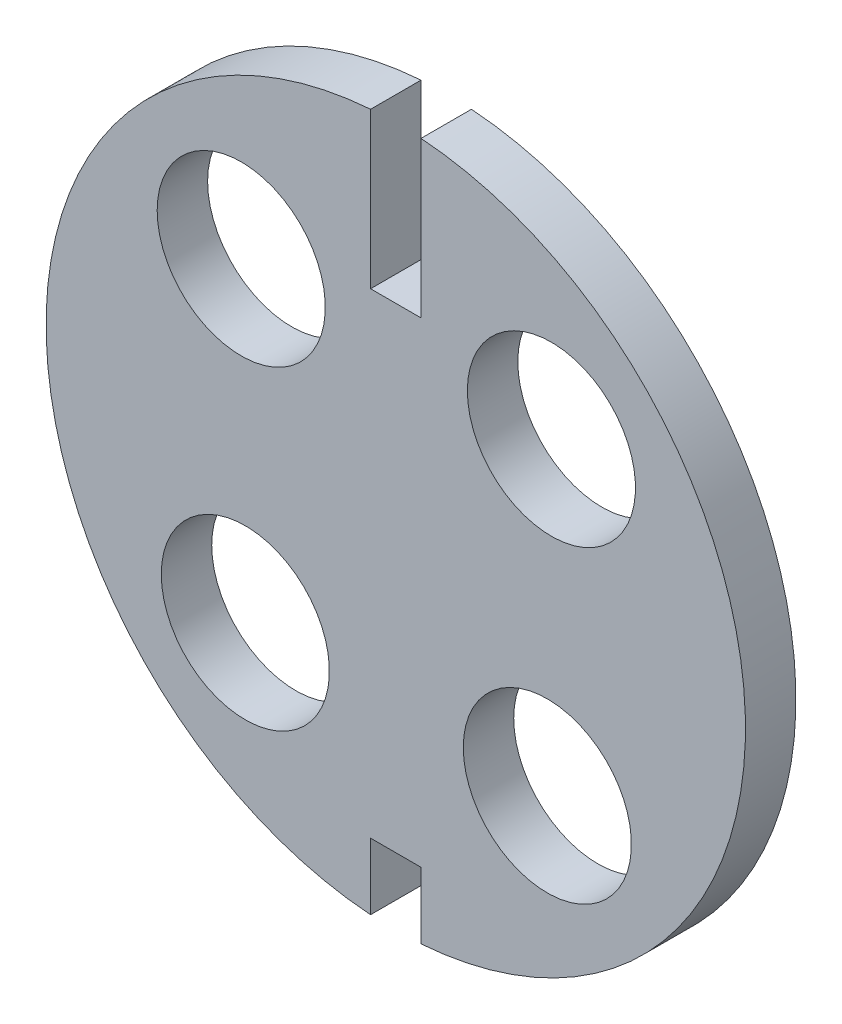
ISO-10303-21;
HEADER;
FILE_DESCRIPTION(('STEP AP214'),'2;1');
FILE_NAME('part.step','',(''),(''),'','','');
FILE_SCHEMA(('AUTOMOTIVE_DESIGN { 1 0 10303 214 1 1 1 1 }'));
ENDSEC;
DATA;
#1=APPLICATION_CONTEXT('core data for automotive mechanical design processes');
#2=APPLICATION_PROTOCOL_DEFINITION('international standard','automotive_design',2000,#1);
#3=PRODUCT_CONTEXT('',#1,'mechanical');
#4=PRODUCT('Part','Part','',(#3));
#5=PRODUCT_RELATED_PRODUCT_CATEGORY('part','',(#4));
#6=PRODUCT_DEFINITION_FORMATION('','',#4);
#7=PRODUCT_DEFINITION_CONTEXT('part definition',#1,'design');
#8=PRODUCT_DEFINITION('design','',#6,#7);
#9=PRODUCT_DEFINITION_SHAPE('','',#8);
#10=(LENGTH_UNIT() NAMED_UNIT(*) SI_UNIT(.MILLI.,.METRE.));
#11=(NAMED_UNIT(*) PLANE_ANGLE_UNIT() SI_UNIT($,.RADIAN.));
#12=(NAMED_UNIT(*) SI_UNIT($,.STERADIAN.) SOLID_ANGLE_UNIT());
#13=UNCERTAINTY_MEASURE_WITH_UNIT(LENGTH_MEASURE(1.E-05),#10,'distance_accuracy_value','');
#14=(GEOMETRIC_REPRESENTATION_CONTEXT(3) GLOBAL_UNCERTAINTY_ASSIGNED_CONTEXT((#13)) GLOBAL_UNIT_ASSIGNED_CONTEXT((#10,
#11,#12)) REPRESENTATION_CONTEXT('',''));
#15=CARTESIAN_POINT('',(0.,0.,0.));
#16=DIRECTION('',(0.,0.,1.));
#17=DIRECTION('',(1.,0.,0.));
#18=AXIS2_PLACEMENT_3D('',#15,#16,#17);
#19=CARTESIAN_POINT('',(0.,0.,3.81));
#20=DIRECTION('',(0.,0.,1.));
#21=DIRECTION('',(1.,0.,0.));
#22=AXIS2_PLACEMENT_3D('',#19,#20,#21);
#23=PLANE('',#22);
#24=CARTESIAN_POINT('',(11.4489030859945,-11.8954915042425,3.81));
#25=DIRECTION('',(0.,0.,1.));
#26=DIRECTION('',(1.,0.,0.));
#27=AXIS2_PLACEMENT_3D('',#24,#25,#26);
#28=CIRCLE('',#27,6.35);
#29=CARTESIAN_POINT('',(5.09890308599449,-11.8954915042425,3.81));
#30=VERTEX_POINT('',#29);
#31=EDGE_CURVE('E156',#30,#30,#28,.T.);
#32=ORIENTED_EDGE('',*,*,#31,.F.);
#33=EDGE_LOOP('',(#32));
#34=FACE_BOUND('',#33,.T.);
#35=CARTESIAN_POINT('',(-11.6743329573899,11.6743329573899,3.81));
#36=DIRECTION('',(0.,0.,1.));
#37=DIRECTION('',(1.,0.,0.));
#38=AXIS2_PLACEMENT_3D('',#35,#36,#37);
#39=CIRCLE('',#38,6.35);
#40=CARTESIAN_POINT('',(-18.0243329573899,11.6743329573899,3.81));
#41=VERTEX_POINT('',#40);
#42=EDGE_CURVE('E168',#41,#41,#39,.T.);
#43=ORIENTED_EDGE('',*,*,#42,.F.);
#44=EDGE_LOOP('',(#43));
#45=FACE_BOUND('',#44,.T.);
#46=CARTESIAN_POINT('',(11.7568886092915,11.5911893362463,3.81));
#47=DIRECTION('',(0.,0.,1.));
#48=DIRECTION('',(1.,0.,0.));
#49=AXIS2_PLACEMENT_3D('',#46,#47,#48);
#50=CIRCLE('',#49,6.35);
#51=CARTESIAN_POINT('',(5.40688860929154,11.5911893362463,3.81));
#52=VERTEX_POINT('',#51);
#53=EDGE_CURVE('E162',#52,#52,#50,.T.);
#54=ORIENTED_EDGE('',*,*,#53,.F.);
#55=EDGE_LOOP('',(#54));
#56=FACE_BOUND('',#55,.T.);
#57=CARTESIAN_POINT('',(-11.3642808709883,-11.9763608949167,3.81));
#58=DIRECTION('',(0.,0.,1.));
#59=DIRECTION('',(1.,0.,0.));
#60=AXIS2_PLACEMENT_3D('',#57,#58,#59);
#61=CIRCLE('',#60,6.35);
#62=CARTESIAN_POINT('',(-17.7142808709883,-11.9763608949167,3.81));
#63=VERTEX_POINT('',#62);
#64=EDGE_CURVE('E150',#63,#63,#61,.T.);
#65=ORIENTED_EDGE('',*,*,#64,.F.);
#66=EDGE_LOOP('',(#65));
#67=FACE_BOUND('',#66,.T.);
#68=DIRECTION('',(-1.,0.,0.));
#69=VECTOR('',#68,1.);
#70=CARTESIAN_POINT('',(1.905,-21.336,3.81));
#71=LINE('',#70,#69);
#72=CARTESIAN_POINT('',(1.905,-21.336,3.81));
#73=VERTEX_POINT('',#72);
#74=CARTESIAN_POINT('',(-1.905,-21.336,3.81));
#75=VERTEX_POINT('',#74);
#76=EDGE_CURVE('E125',#73,#75,#71,.T.);
#77=ORIENTED_EDGE('',*,*,#76,.F.);
#78=DIRECTION('',(0.,1.,0.));
#79=VECTOR('',#78,1.);
#80=CARTESIAN_POINT('',(1.905,-27.9234461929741,3.81));
#81=LINE('',#80,#79);
#82=CARTESIAN_POINT('',(1.905,-26.3472205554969,3.81));
#83=VERTEX_POINT('',#82);
#84=EDGE_CURVE('E114',#83,#73,#81,.T.);
#85=ORIENTED_EDGE('',*,*,#84,.F.);
#86=CARTESIAN_POINT('',(0.,0.,3.81));
#87=DIRECTION('',(0.,0.,1.));
#88=DIRECTION('',(1.,0.,0.));
#89=AXIS2_PLACEMENT_3D('',#86,#87,#88);
#90=CIRCLE('',#89,26.416);
#91=CARTESIAN_POINT('',(1.905,26.3472205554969,3.81));
#92=VERTEX_POINT('',#91);
#93=EDGE_CURVE('E54',#83,#92,#90,.T.);
#94=ORIENTED_EDGE('',*,*,#93,.T.);
#95=DIRECTION('',(0.,1.,0.));
#96=VECTOR('',#95,1.);
#97=CARTESIAN_POINT('',(1.905,27.419564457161,3.81));
#98=LINE('',#97,#96);
#99=CARTESIAN_POINT('',(1.905,14.605,3.81));
#100=VERTEX_POINT('',#99);
#101=EDGE_CURVE('E140',#100,#92,#98,.T.);
#102=ORIENTED_EDGE('',*,*,#101,.F.);
#103=DIRECTION('',(1.,0.,0.));
#104=VECTOR('',#103,1.);
#105=CARTESIAN_POINT('',(-1.905,14.605,3.81));
#106=LINE('',#105,#104);
#107=CARTESIAN_POINT('',(-1.905,14.605,3.81));
#108=VERTEX_POINT('',#107);
#109=EDGE_CURVE('E138',#108,#100,#106,.T.);
#110=ORIENTED_EDGE('',*,*,#109,.F.);
#111=DIRECTION('',(0.,-1.,0.));
#112=VECTOR('',#111,1.);
#113=CARTESIAN_POINT('',(-1.905,27.419564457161,3.81));
#114=LINE('',#113,#112);
#115=CARTESIAN_POINT('',(-1.905,26.3472205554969,3.81));
#116=VERTEX_POINT('',#115);
#117=EDGE_CURVE('E136',#116,#108,#114,.T.);
#118=ORIENTED_EDGE('',*,*,#117,.F.);
#119=CARTESIAN_POINT('',(-1.905,-26.3472205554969,3.81));
#120=VERTEX_POINT('',#119);
#121=EDGE_CURVE('E174',#116,#120,#90,.T.);
#122=ORIENTED_EDGE('',*,*,#121,.T.);
#123=DIRECTION('',(0.,-1.,0.));
#124=VECTOR('',#123,1.);
#125=CARTESIAN_POINT('',(-1.905,-27.9234461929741,3.81));
#126=LINE('',#125,#124);
#127=EDGE_CURVE('E46',#75,#120,#126,.T.);
#128=ORIENTED_EDGE('',*,*,#127,.F.);
#129=EDGE_LOOP('',(#77,#85,#94,#102,#110,#118,#122,#128));
#130=FACE_BOUND('',#129,.T.);
#131=ADVANCED_FACE('F31',(#34,#45,#56,#67,#130),#23,.T.);
#132=CARTESIAN_POINT('',(0.,0.,0.));
#133=DIRECTION('',(0.,0.,1.));
#134=DIRECTION('',(1.,0.,0.));
#135=AXIS2_PLACEMENT_3D('',#132,#133,#134);
#136=PLANE('',#135);
#137=CARTESIAN_POINT('',(11.4489030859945,-11.8954915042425,0.));
#138=DIRECTION('',(0.,0.,1.));
#139=DIRECTION('',(1.,0.,0.));
#140=AXIS2_PLACEMENT_3D('',#137,#138,#139);
#141=CIRCLE('',#140,6.35);
#142=CARTESIAN_POINT('',(5.09890308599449,-11.8954915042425,0.));
#143=VERTEX_POINT('',#142);
#144=EDGE_CURVE('E153',#143,#143,#141,.T.);
#145=ORIENTED_EDGE('',*,*,#144,.T.);
#146=EDGE_LOOP('',(#145));
#147=FACE_BOUND('',#146,.T.);
#148=CARTESIAN_POINT('',(-11.6743329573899,11.6743329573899,0.));
#149=DIRECTION('',(0.,0.,1.));
#150=DIRECTION('',(1.,0.,0.));
#151=AXIS2_PLACEMENT_3D('',#148,#149,#150);
#152=CIRCLE('',#151,6.35);
#153=CARTESIAN_POINT('',(-18.0243329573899,11.6743329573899,0.));
#154=VERTEX_POINT('',#153);
#155=EDGE_CURVE('E165',#154,#154,#152,.T.);
#156=ORIENTED_EDGE('',*,*,#155,.T.);
#157=EDGE_LOOP('',(#156));
#158=FACE_BOUND('',#157,.T.);
#159=CARTESIAN_POINT('',(11.7568886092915,11.5911893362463,0.));
#160=DIRECTION('',(0.,0.,1.));
#161=DIRECTION('',(1.,0.,0.));
#162=AXIS2_PLACEMENT_3D('',#159,#160,#161);
#163=CIRCLE('',#162,6.35);
#164=CARTESIAN_POINT('',(5.40688860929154,11.5911893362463,0.));
#165=VERTEX_POINT('',#164);
#166=EDGE_CURVE('E159',#165,#165,#163,.T.);
#167=ORIENTED_EDGE('',*,*,#166,.T.);
#168=EDGE_LOOP('',(#167));
#169=FACE_BOUND('',#168,.T.);
#170=CARTESIAN_POINT('',(-11.3642808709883,-11.9763608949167,0.));
#171=DIRECTION('',(0.,0.,1.));
#172=DIRECTION('',(1.,0.,0.));
#173=AXIS2_PLACEMENT_3D('',#170,#171,#172);
#174=CIRCLE('',#173,6.35);
#175=CARTESIAN_POINT('',(-17.7142808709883,-11.9763608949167,0.));
#176=VERTEX_POINT('',#175);
#177=EDGE_CURVE('E147',#176,#176,#174,.T.);
#178=ORIENTED_EDGE('',*,*,#177,.T.);
#179=EDGE_LOOP('',(#178));
#180=FACE_BOUND('',#179,.T.);
#181=DIRECTION('',(0.,1.,0.));
#182=VECTOR('',#181,1.);
#183=CARTESIAN_POINT('',(1.905,-27.9234461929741,0.));
#184=LINE('',#183,#182);
#185=CARTESIAN_POINT('',(1.905,-26.3472205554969,0.));
#186=VERTEX_POINT('',#185);
#187=CARTESIAN_POINT('',(1.905,-21.336,0.));
#188=VERTEX_POINT('',#187);
#189=EDGE_CURVE('E109',#186,#188,#184,.T.);
#190=ORIENTED_EDGE('',*,*,#189,.T.);
#191=DIRECTION('',(-1.,0.,0.));
#192=VECTOR('',#191,1.);
#193=CARTESIAN_POINT('',(1.905,-21.336,0.));
#194=LINE('',#193,#192);
#195=CARTESIAN_POINT('',(-1.905,-21.336,0.));
#196=VERTEX_POINT('',#195);
#197=EDGE_CURVE('E98',#188,#196,#194,.T.);
#198=ORIENTED_EDGE('',*,*,#197,.T.);
#199=DIRECTION('',(0.,-1.,0.));
#200=VECTOR('',#199,1.);
#201=CARTESIAN_POINT('',(-1.905,-27.9234461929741,0.));
#202=LINE('',#201,#200);
#203=CARTESIAN_POINT('',(-1.905,-26.3472205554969,0.));
#204=VERTEX_POINT('',#203);
#205=EDGE_CURVE('E108',#196,#204,#202,.T.);
#206=ORIENTED_EDGE('',*,*,#205,.T.);
#207=CARTESIAN_POINT('',(0.,0.,0.));
#208=DIRECTION('',(0.,0.,1.));
#209=DIRECTION('',(1.,0.,0.));
#210=AXIS2_PLACEMENT_3D('',#207,#208,#209);
#211=CIRCLE('',#210,26.416);
#212=CARTESIAN_POINT('',(-1.905,26.3472205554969,0.));
#213=VERTEX_POINT('',#212);
#214=EDGE_CURVE('E171',#213,#204,#211,.T.);
#215=ORIENTED_EDGE('',*,*,#214,.F.);
#216=DIRECTION('',(0.,-1.,0.));
#217=VECTOR('',#216,1.);
#218=CARTESIAN_POINT('',(-1.905,27.419564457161,0.));
#219=LINE('',#218,#217);
#220=CARTESIAN_POINT('',(-1.905,14.605,0.));
#221=VERTEX_POINT('',#220);
#222=EDGE_CURVE('E115',#213,#221,#219,.T.);
#223=ORIENTED_EDGE('',*,*,#222,.T.);
#224=DIRECTION('',(1.,0.,0.));
#225=VECTOR('',#224,1.);
#226=CARTESIAN_POINT('',(-1.905,14.605,0.));
#227=LINE('',#226,#225);
#228=CARTESIAN_POINT('',(1.905,14.605,0.));
#229=VERTEX_POINT('',#228);
#230=EDGE_CURVE('E131',#221,#229,#227,.T.);
#231=ORIENTED_EDGE('',*,*,#230,.T.);
#232=DIRECTION('',(0.,1.,0.));
#233=VECTOR('',#232,1.);
#234=CARTESIAN_POINT('',(1.905,27.419564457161,0.));
#235=LINE('',#234,#233);
#236=CARTESIAN_POINT('',(1.905,26.3472205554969,0.));
#237=VERTEX_POINT('',#236);
#238=EDGE_CURVE('E134',#229,#237,#235,.T.);
#239=ORIENTED_EDGE('',*,*,#238,.T.);
#240=EDGE_CURVE('E120',#186,#237,#211,.T.);
#241=ORIENTED_EDGE('',*,*,#240,.F.);
#242=EDGE_LOOP('',(#190,#198,#206,#215,#223,#231,#239,#241));
#243=FACE_BOUND('',#242,.T.);
#244=ADVANCED_FACE('F118',(#147,#158,#169,#180,#243),#136,.F.);
#245=CARTESIAN_POINT('',(0.,0.,3.81));
#246=DIRECTION('',(0.,0.,-1.));
#247=DIRECTION('',(-1.,0.,0.));
#248=AXIS2_PLACEMENT_3D('',#245,#246,#247);
#249=CYLINDRICAL_SURFACE('',#248,26.416);
#250=DIRECTION('',(0.,0.,-1.));
#251=VECTOR('',#250,1.);
#252=CARTESIAN_POINT('',(1.905,-26.3472205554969,3.81));
#253=LINE('',#252,#251);
#254=EDGE_CURVE('E11',#186,#83,#253,.F.);
#255=ORIENTED_EDGE('',*,*,#254,.F.);
#256=ORIENTED_EDGE('',*,*,#240,.T.);
#257=DIRECTION('',(0.,0.,-1.));
#258=VECTOR('',#257,1.);
#259=CARTESIAN_POINT('',(1.905,26.3472205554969,3.81));
#260=LINE('',#259,#258);
#261=EDGE_CURVE('E177',#92,#237,#260,.T.);
#262=ORIENTED_EDGE('',*,*,#261,.F.);
#263=ORIENTED_EDGE('',*,*,#93,.F.);
#264=EDGE_LOOP('',(#255,#256,#262,#263));
#265=FACE_BOUND('',#264,.T.);
#266=ADVANCED_FACE('F33',(#265),#249,.T.);
#267=DIRECTION('',(0.,0.,-1.));
#268=VECTOR('',#267,1.);
#269=CARTESIAN_POINT('',(-1.905,-26.3472205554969,3.81));
#270=LINE('',#269,#268);
#271=EDGE_CURVE('E39',#120,#204,#270,.T.);
#272=ORIENTED_EDGE('',*,*,#271,.F.);
#273=ORIENTED_EDGE('',*,*,#121,.F.);
#274=DIRECTION('',(0.,0.,-1.));
#275=VECTOR('',#274,1.);
#276=CARTESIAN_POINT('',(-1.905,26.3472205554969,3.81));
#277=LINE('',#276,#275);
#278=EDGE_CURVE('E180',#213,#116,#277,.F.);
#279=ORIENTED_EDGE('',*,*,#278,.F.);
#280=ORIENTED_EDGE('',*,*,#214,.T.);
#281=EDGE_LOOP('',(#272,#273,#279,#280));
#282=FACE_BOUND('',#281,.T.);
#283=ADVANCED_FACE('F186',(#282),#249,.T.);
#284=CARTESIAN_POINT('',(-11.6743329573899,11.6743329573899,3.81));
#285=DIRECTION('',(0.,0.,-1.));
#286=DIRECTION('',(-1.,0.,0.));
#287=AXIS2_PLACEMENT_3D('',#284,#285,#286);
#288=CYLINDRICAL_SURFACE('',#287,6.35);
#289=CARTESIAN_POINT('',(-18.0243329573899,11.6743329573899,3.81));
#290=CARTESIAN_POINT('',(-18.0243329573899,11.6743329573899,3.7703125));
#291=CARTESIAN_POINT('',(-18.0243329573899,11.6743329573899,3.730625));
#292=CARTESIAN_POINT('',(-18.0243329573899,11.6743329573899,3.65125));
#293=CARTESIAN_POINT('',(-18.0243329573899,11.6743329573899,3.6115625));
#294=CARTESIAN_POINT('',(-18.0243329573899,11.6743329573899,3.5321875));
#295=CARTESIAN_POINT('',(-18.0243329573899,11.6743329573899,3.4925));
#296=CARTESIAN_POINT('',(-18.0243329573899,11.6743329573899,3.413125));
#297=CARTESIAN_POINT('',(-18.0243329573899,11.6743329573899,3.3734375));
#298=CARTESIAN_POINT('',(-18.0243329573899,11.6743329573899,3.2940625));
#299=CARTESIAN_POINT('',(-18.0243329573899,11.6743329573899,3.254375));
#300=CARTESIAN_POINT('',(-18.0243329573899,11.6743329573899,3.175));
#301=CARTESIAN_POINT('',(-18.0243329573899,11.6743329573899,3.1353125));
#302=CARTESIAN_POINT('',(-18.0243329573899,11.6743329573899,3.0559375));
#303=CARTESIAN_POINT('',(-18.0243329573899,11.6743329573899,3.01625));
#304=CARTESIAN_POINT('',(-18.0243329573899,11.6743329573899,2.936875));
#305=CARTESIAN_POINT('',(-18.0243329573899,11.6743329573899,2.8971875));
#306=CARTESIAN_POINT('',(-18.0243329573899,11.6743329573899,2.8178125));
#307=CARTESIAN_POINT('',(-18.0243329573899,11.6743329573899,2.778125));
#308=CARTESIAN_POINT('',(-18.0243329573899,11.6743329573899,2.69875));
#309=CARTESIAN_POINT('',(-18.0243329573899,11.6743329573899,2.6590625));
#310=CARTESIAN_POINT('',(-18.0243329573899,11.6743329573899,2.5796875));
#311=CARTESIAN_POINT('',(-18.0243329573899,11.6743329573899,2.54));
#312=CARTESIAN_POINT('',(-18.0243329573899,11.6743329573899,2.460625));
#313=CARTESIAN_POINT('',(-18.0243329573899,11.6743329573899,2.4209375));
#314=CARTESIAN_POINT('',(-18.0243329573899,11.6743329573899,2.3415625));
#315=CARTESIAN_POINT('',(-18.0243329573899,11.6743329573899,2.301875));
#316=CARTESIAN_POINT('',(-18.0243329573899,11.6743329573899,2.2225));
#317=CARTESIAN_POINT('',(-18.0243329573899,11.6743329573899,2.1828125));
#318=CARTESIAN_POINT('',(-18.0243329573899,11.6743329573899,2.1034375));
#319=CARTESIAN_POINT('',(-18.0243329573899,11.6743329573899,2.06375));
#320=CARTESIAN_POINT('',(-18.0243329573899,11.6743329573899,1.984375));
#321=CARTESIAN_POINT('',(-18.0243329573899,11.6743329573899,1.9446875));
#322=CARTESIAN_POINT('',(-18.0243329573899,11.6743329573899,1.8653125));
#323=CARTESIAN_POINT('',(-18.0243329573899,11.6743329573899,1.825625));
#324=CARTESIAN_POINT('',(-18.0243329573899,11.6743329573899,1.74625));
#325=CARTESIAN_POINT('',(-18.0243329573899,11.6743329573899,1.7065625));
#326=CARTESIAN_POINT('',(-18.0243329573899,11.6743329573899,1.6271875));
#327=CARTESIAN_POINT('',(-18.0243329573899,11.6743329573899,1.5875));
#328=CARTESIAN_POINT('',(-18.0243329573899,11.6743329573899,1.508125));
#329=CARTESIAN_POINT('',(-18.0243329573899,11.6743329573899,1.4684375));
#330=CARTESIAN_POINT('',(-18.0243329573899,11.6743329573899,1.3890625));
#331=CARTESIAN_POINT('',(-18.0243329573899,11.6743329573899,1.349375));
#332=CARTESIAN_POINT('',(-18.0243329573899,11.6743329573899,1.27));
#333=CARTESIAN_POINT('',(-18.0243329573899,11.6743329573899,1.2303125));
#334=CARTESIAN_POINT('',(-18.0243329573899,11.6743329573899,1.1509375));
#335=CARTESIAN_POINT('',(-18.0243329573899,11.6743329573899,1.11125));
#336=CARTESIAN_POINT('',(-18.0243329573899,11.6743329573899,1.031875));
#337=CARTESIAN_POINT('',(-18.0243329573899,11.6743329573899,0.9921875));
#338=CARTESIAN_POINT('',(-18.0243329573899,11.6743329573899,0.9128125));
#339=CARTESIAN_POINT('',(-18.0243329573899,11.6743329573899,0.873125));
#340=CARTESIAN_POINT('',(-18.0243329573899,11.6743329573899,0.79375));
#341=CARTESIAN_POINT('',(-18.0243329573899,11.6743329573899,0.7540625));
#342=CARTESIAN_POINT('',(-18.0243329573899,11.6743329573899,0.6746875));
#343=CARTESIAN_POINT('',(-18.0243329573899,11.6743329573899,0.635));
#344=CARTESIAN_POINT('',(-18.0243329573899,11.6743329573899,0.555625));
#345=CARTESIAN_POINT('',(-18.0243329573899,11.6743329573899,0.5159375));
#346=CARTESIAN_POINT('',(-18.0243329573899,11.6743329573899,0.4365625));
#347=CARTESIAN_POINT('',(-18.0243329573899,11.6743329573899,0.396875));
#348=CARTESIAN_POINT('',(-18.0243329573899,11.6743329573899,0.3175));
#349=CARTESIAN_POINT('',(-18.0243329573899,11.6743329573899,0.2778125));
#350=CARTESIAN_POINT('',(-18.0243329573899,11.6743329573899,0.1984375));
#351=CARTESIAN_POINT('',(-18.0243329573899,11.6743329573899,0.15875));
#352=CARTESIAN_POINT('',(-18.0243329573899,11.6743329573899,0.0793749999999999));
#353=CARTESIAN_POINT('',(-18.0243329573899,11.6743329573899,0.0396874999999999));
#354=CARTESIAN_POINT('',(-18.0243329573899,11.6743329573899,0.));
#355=B_SPLINE_CURVE_WITH_KNOTS('',3,(#289,#290,#291,#292,#293,#294,#295,#296,#297,#298,#299,
#300,#301,#302,#303,#304,#305,#306,#307,#308,#309,#310,#311,#312,#313,#314,#315,#316,#317,#318,
#319,#320,#321,#322,#323,#324,#325,#326,#327,#328,#329,#330,#331,#332,#333,#334,#335,#336,#337,
#338,#339,#340,#341,#342,#343,#344,#345,#346,#347,#348,#349,#350,#351,#352,#353,#354),
.UNSPECIFIED.,.F.,.F.,(4,2,2,2,2,2,2,2,2,2,2,2,2,2,2,2,2,2,2,2,2,2,2,2,2,2,2,2,2,2,2,2,4),(0.,
0.1190625,0.238125,0.3571875,0.47625,0.5953125,0.714375,0.8334375,0.9525,1.0715625,1.190625,
1.3096875,1.42875,1.5478125,1.666875,1.7859375,1.905,2.0240625,2.143125,2.2621875,2.38125,
2.5003125,2.619375,2.7384375,2.8575,2.9765625,3.095625,3.2146875,3.33375,3.4528125,3.571875,
3.6909375,3.81),.UNSPECIFIED.);
#356=EDGE_CURVE('BSEAM205',#41,#154,#355,.T.);
#357=ORIENTED_EDGE('',*,*,#42,.T.);
#358=ORIENTED_EDGE('',*,*,#155,.F.);
#359=ORIENTED_EDGE('',*,*,#356,.T.);
#360=ORIENTED_EDGE('',*,*,#356,.F.);
#361=EDGE_LOOP('',(#357,#359,#358,#360));
#362=FACE_BOUND('',#361,.T.);
#363=ADVANCED_FACE('F205',(#362),#288,.F.);
#364=CARTESIAN_POINT('',(11.7568886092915,11.5911893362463,3.81));
#365=DIRECTION('',(0.,0.,-1.));
#366=DIRECTION('',(-1.,0.,0.));
#367=AXIS2_PLACEMENT_3D('',#364,#365,#366);
#368=CYLINDRICAL_SURFACE('',#367,6.35);
#369=CARTESIAN_POINT('',(5.40688860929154,11.5911893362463,3.81));
#370=CARTESIAN_POINT('',(5.40688860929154,11.5911893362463,3.7703125));
#371=CARTESIAN_POINT('',(5.40688860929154,11.5911893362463,3.730625));
#372=CARTESIAN_POINT('',(5.40688860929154,11.5911893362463,3.65125));
#373=CARTESIAN_POINT('',(5.40688860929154,11.5911893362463,3.6115625));
#374=CARTESIAN_POINT('',(5.40688860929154,11.5911893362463,3.5321875));
#375=CARTESIAN_POINT('',(5.40688860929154,11.5911893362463,3.4925));
#376=CARTESIAN_POINT('',(5.40688860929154,11.5911893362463,3.413125));
#377=CARTESIAN_POINT('',(5.40688860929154,11.5911893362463,3.3734375));
#378=CARTESIAN_POINT('',(5.40688860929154,11.5911893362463,3.2940625));
#379=CARTESIAN_POINT('',(5.40688860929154,11.5911893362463,3.254375));
#380=CARTESIAN_POINT('',(5.40688860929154,11.5911893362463,3.175));
#381=CARTESIAN_POINT('',(5.40688860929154,11.5911893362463,3.1353125));
#382=CARTESIAN_POINT('',(5.40688860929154,11.5911893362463,3.0559375));
#383=CARTESIAN_POINT('',(5.40688860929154,11.5911893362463,3.01625));
#384=CARTESIAN_POINT('',(5.40688860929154,11.5911893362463,2.936875));
#385=CARTESIAN_POINT('',(5.40688860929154,11.5911893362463,2.8971875));
#386=CARTESIAN_POINT('',(5.40688860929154,11.5911893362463,2.8178125));
#387=CARTESIAN_POINT('',(5.40688860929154,11.5911893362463,2.778125));
#388=CARTESIAN_POINT('',(5.40688860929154,11.5911893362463,2.69875));
#389=CARTESIAN_POINT('',(5.40688860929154,11.5911893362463,2.6590625));
#390=CARTESIAN_POINT('',(5.40688860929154,11.5911893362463,2.5796875));
#391=CARTESIAN_POINT('',(5.40688860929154,11.5911893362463,2.54));
#392=CARTESIAN_POINT('',(5.40688860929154,11.5911893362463,2.460625));
#393=CARTESIAN_POINT('',(5.40688860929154,11.5911893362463,2.4209375));
#394=CARTESIAN_POINT('',(5.40688860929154,11.5911893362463,2.3415625));
#395=CARTESIAN_POINT('',(5.40688860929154,11.5911893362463,2.301875));
#396=CARTESIAN_POINT('',(5.40688860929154,11.5911893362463,2.2225));
#397=CARTESIAN_POINT('',(5.40688860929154,11.5911893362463,2.1828125));
#398=CARTESIAN_POINT('',(5.40688860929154,11.5911893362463,2.1034375));
#399=CARTESIAN_POINT('',(5.40688860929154,11.5911893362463,2.06375));
#400=CARTESIAN_POINT('',(5.40688860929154,11.5911893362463,1.984375));
#401=CARTESIAN_POINT('',(5.40688860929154,11.5911893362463,1.9446875));
#402=CARTESIAN_POINT('',(5.40688860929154,11.5911893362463,1.8653125));
#403=CARTESIAN_POINT('',(5.40688860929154,11.5911893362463,1.825625));
#404=CARTESIAN_POINT('',(5.40688860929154,11.5911893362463,1.74625));
#405=CARTESIAN_POINT('',(5.40688860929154,11.5911893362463,1.7065625));
#406=CARTESIAN_POINT('',(5.40688860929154,11.5911893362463,1.6271875));
#407=CARTESIAN_POINT('',(5.40688860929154,11.5911893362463,1.5875));
#408=CARTESIAN_POINT('',(5.40688860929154,11.5911893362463,1.508125));
#409=CARTESIAN_POINT('',(5.40688860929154,11.5911893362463,1.4684375));
#410=CARTESIAN_POINT('',(5.40688860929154,11.5911893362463,1.3890625));
#411=CARTESIAN_POINT('',(5.40688860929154,11.5911893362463,1.349375));
#412=CARTESIAN_POINT('',(5.40688860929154,11.5911893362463,1.27));
#413=CARTESIAN_POINT('',(5.40688860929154,11.5911893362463,1.2303125));
#414=CARTESIAN_POINT('',(5.40688860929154,11.5911893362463,1.1509375));
#415=CARTESIAN_POINT('',(5.40688860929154,11.5911893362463,1.11125));
#416=CARTESIAN_POINT('',(5.40688860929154,11.5911893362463,1.031875));
#417=CARTESIAN_POINT('',(5.40688860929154,11.5911893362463,0.9921875));
#418=CARTESIAN_POINT('',(5.40688860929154,11.5911893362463,0.9128125));
#419=CARTESIAN_POINT('',(5.40688860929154,11.5911893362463,0.873125));
#420=CARTESIAN_POINT('',(5.40688860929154,11.5911893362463,0.79375));
#421=CARTESIAN_POINT('',(5.40688860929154,11.5911893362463,0.7540625));
#422=CARTESIAN_POINT('',(5.40688860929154,11.5911893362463,0.6746875));
#423=CARTESIAN_POINT('',(5.40688860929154,11.5911893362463,0.635));
#424=CARTESIAN_POINT('',(5.40688860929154,11.5911893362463,0.555625));
#425=CARTESIAN_POINT('',(5.40688860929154,11.5911893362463,0.5159375));
#426=CARTESIAN_POINT('',(5.40688860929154,11.5911893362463,0.4365625));
#427=CARTESIAN_POINT('',(5.40688860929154,11.5911893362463,0.396875));
#428=CARTESIAN_POINT('',(5.40688860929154,11.5911893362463,0.3175));
#429=CARTESIAN_POINT('',(5.40688860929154,11.5911893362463,0.2778125));
#430=CARTESIAN_POINT('',(5.40688860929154,11.5911893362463,0.1984375));
#431=CARTESIAN_POINT('',(5.40688860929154,11.5911893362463,0.15875));
#432=CARTESIAN_POINT('',(5.40688860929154,11.5911893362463,0.0793749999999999));
#433=CARTESIAN_POINT('',(5.40688860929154,11.5911893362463,0.0396874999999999));
#434=CARTESIAN_POINT('',(5.40688860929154,11.5911893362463,0.));
#435=B_SPLINE_CURVE_WITH_KNOTS('',3,(#369,#370,#371,#372,#373,#374,#375,#376,#377,#378,#379,
#380,#381,#382,#383,#384,#385,#386,#387,#388,#389,#390,#391,#392,#393,#394,#395,#396,#397,#398,
#399,#400,#401,#402,#403,#404,#405,#406,#407,#408,#409,#410,#411,#412,#413,#414,#415,#416,#417,
#418,#419,#420,#421,#422,#423,#424,#425,#426,#427,#428,#429,#430,#431,#432,#433,#434),
.UNSPECIFIED.,.F.,.F.,(4,2,2,2,2,2,2,2,2,2,2,2,2,2,2,2,2,2,2,2,2,2,2,2,2,2,2,2,2,2,2,2,4),(0.,
0.1190625,0.238125,0.3571875,0.47625,0.5953125,0.714375,0.8334375,0.9525,1.0715625,1.190625,
1.3096875,1.42875,1.5478125,1.666875,1.7859375,1.905,2.0240625,2.143125,2.2621875,2.38125,
2.5003125,2.619375,2.7384375,2.8575,2.9765625,3.095625,3.2146875,3.33375,3.4528125,3.571875,
3.6909375,3.81),.UNSPECIFIED.);
#436=EDGE_CURVE('BSEAM217',#52,#165,#435,.T.);
#437=ORIENTED_EDGE('',*,*,#53,.T.);
#438=ORIENTED_EDGE('',*,*,#166,.F.);
#439=ORIENTED_EDGE('',*,*,#436,.T.);
#440=ORIENTED_EDGE('',*,*,#436,.F.);
#441=EDGE_LOOP('',(#437,#439,#438,#440));
#442=FACE_BOUND('',#441,.T.);
#443=ADVANCED_FACE('F217',(#442),#368,.F.);
#444=CARTESIAN_POINT('',(11.4489030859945,-11.8954915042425,3.81));
#445=DIRECTION('',(0.,0.,-1.));
#446=DIRECTION('',(-1.,0.,0.));
#447=AXIS2_PLACEMENT_3D('',#444,#445,#446);
#448=CYLINDRICAL_SURFACE('',#447,6.35);
#449=CARTESIAN_POINT('',(5.09890308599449,-11.8954915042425,3.81));
#450=CARTESIAN_POINT('',(5.09890308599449,-11.8954915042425,3.7703125));
#451=CARTESIAN_POINT('',(5.09890308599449,-11.8954915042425,3.730625));
#452=CARTESIAN_POINT('',(5.09890308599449,-11.8954915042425,3.65125));
#453=CARTESIAN_POINT('',(5.09890308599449,-11.8954915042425,3.6115625));
#454=CARTESIAN_POINT('',(5.09890308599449,-11.8954915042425,3.5321875));
#455=CARTESIAN_POINT('',(5.09890308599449,-11.8954915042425,3.4925));
#456=CARTESIAN_POINT('',(5.09890308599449,-11.8954915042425,3.413125));
#457=CARTESIAN_POINT('',(5.09890308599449,-11.8954915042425,3.3734375));
#458=CARTESIAN_POINT('',(5.09890308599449,-11.8954915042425,3.2940625));
#459=CARTESIAN_POINT('',(5.09890308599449,-11.8954915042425,3.254375));
#460=CARTESIAN_POINT('',(5.09890308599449,-11.8954915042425,3.175));
#461=CARTESIAN_POINT('',(5.09890308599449,-11.8954915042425,3.1353125));
#462=CARTESIAN_POINT('',(5.09890308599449,-11.8954915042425,3.0559375));
#463=CARTESIAN_POINT('',(5.09890308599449,-11.8954915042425,3.01625));
#464=CARTESIAN_POINT('',(5.09890308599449,-11.8954915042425,2.936875));
#465=CARTESIAN_POINT('',(5.09890308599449,-11.8954915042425,2.8971875));
#466=CARTESIAN_POINT('',(5.09890308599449,-11.8954915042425,2.8178125));
#467=CARTESIAN_POINT('',(5.09890308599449,-11.8954915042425,2.778125));
#468=CARTESIAN_POINT('',(5.09890308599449,-11.8954915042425,2.69875));
#469=CARTESIAN_POINT('',(5.09890308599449,-11.8954915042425,2.6590625));
#470=CARTESIAN_POINT('',(5.09890308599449,-11.8954915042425,2.5796875));
#471=CARTESIAN_POINT('',(5.09890308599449,-11.8954915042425,2.54));
#472=CARTESIAN_POINT('',(5.09890308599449,-11.8954915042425,2.460625));
#473=CARTESIAN_POINT('',(5.09890308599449,-11.8954915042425,2.4209375));
#474=CARTESIAN_POINT('',(5.09890308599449,-11.8954915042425,2.3415625));
#475=CARTESIAN_POINT('',(5.09890308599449,-11.8954915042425,2.301875));
#476=CARTESIAN_POINT('',(5.09890308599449,-11.8954915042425,2.2225));
#477=CARTESIAN_POINT('',(5.09890308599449,-11.8954915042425,2.1828125));
#478=CARTESIAN_POINT('',(5.09890308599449,-11.8954915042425,2.1034375));
#479=CARTESIAN_POINT('',(5.09890308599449,-11.8954915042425,2.06375));
#480=CARTESIAN_POINT('',(5.09890308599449,-11.8954915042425,1.984375));
#481=CARTESIAN_POINT('',(5.09890308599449,-11.8954915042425,1.9446875));
#482=CARTESIAN_POINT('',(5.09890308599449,-11.8954915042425,1.8653125));
#483=CARTESIAN_POINT('',(5.09890308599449,-11.8954915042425,1.825625));
#484=CARTESIAN_POINT('',(5.09890308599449,-11.8954915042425,1.74625));
#485=CARTESIAN_POINT('',(5.09890308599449,-11.8954915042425,1.7065625));
#486=CARTESIAN_POINT('',(5.09890308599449,-11.8954915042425,1.6271875));
#487=CARTESIAN_POINT('',(5.09890308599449,-11.8954915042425,1.5875));
#488=CARTESIAN_POINT('',(5.09890308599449,-11.8954915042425,1.508125));
#489=CARTESIAN_POINT('',(5.09890308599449,-11.8954915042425,1.4684375));
#490=CARTESIAN_POINT('',(5.09890308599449,-11.8954915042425,1.3890625));
#491=CARTESIAN_POINT('',(5.09890308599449,-11.8954915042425,1.349375));
#492=CARTESIAN_POINT('',(5.09890308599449,-11.8954915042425,1.27));
#493=CARTESIAN_POINT('',(5.09890308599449,-11.8954915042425,1.2303125));
#494=CARTESIAN_POINT('',(5.09890308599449,-11.8954915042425,1.1509375));
#495=CARTESIAN_POINT('',(5.09890308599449,-11.8954915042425,1.11125));
#496=CARTESIAN_POINT('',(5.09890308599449,-11.8954915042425,1.031875));
#497=CARTESIAN_POINT('',(5.09890308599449,-11.8954915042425,0.9921875));
#498=CARTESIAN_POINT('',(5.09890308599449,-11.8954915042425,0.9128125));
#499=CARTESIAN_POINT('',(5.09890308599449,-11.8954915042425,0.873125));
#500=CARTESIAN_POINT('',(5.09890308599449,-11.8954915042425,0.79375));
#501=CARTESIAN_POINT('',(5.09890308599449,-11.8954915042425,0.7540625));
#502=CARTESIAN_POINT('',(5.09890308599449,-11.8954915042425,0.6746875));
#503=CARTESIAN_POINT('',(5.09890308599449,-11.8954915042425,0.635));
#504=CARTESIAN_POINT('',(5.09890308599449,-11.8954915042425,0.555625));
#505=CARTESIAN_POINT('',(5.09890308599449,-11.8954915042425,0.5159375));
#506=CARTESIAN_POINT('',(5.09890308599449,-11.8954915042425,0.4365625));
#507=CARTESIAN_POINT('',(5.09890308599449,-11.8954915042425,0.396875));
#508=CARTESIAN_POINT('',(5.09890308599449,-11.8954915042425,0.3175));
#509=CARTESIAN_POINT('',(5.09890308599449,-11.8954915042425,0.2778125));
#510=CARTESIAN_POINT('',(5.09890308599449,-11.8954915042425,0.1984375));
#511=CARTESIAN_POINT('',(5.09890308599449,-11.8954915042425,0.15875));
#512=CARTESIAN_POINT('',(5.09890308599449,-11.8954915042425,0.0793749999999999));
#513=CARTESIAN_POINT('',(5.09890308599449,-11.8954915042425,0.0396874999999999));
#514=CARTESIAN_POINT('',(5.09890308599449,-11.8954915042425,0.));
#515=B_SPLINE_CURVE_WITH_KNOTS('',3,(#449,#450,#451,#452,#453,#454,#455,#456,#457,#458,#459,
#460,#461,#462,#463,#464,#465,#466,#467,#468,#469,#470,#471,#472,#473,#474,#475,#476,#477,#478,
#479,#480,#481,#482,#483,#484,#485,#486,#487,#488,#489,#490,#491,#492,#493,#494,#495,#496,#497,
#498,#499,#500,#501,#502,#503,#504,#505,#506,#507,#508,#509,#510,#511,#512,#513,#514),
.UNSPECIFIED.,.F.,.F.,(4,2,2,2,2,2,2,2,2,2,2,2,2,2,2,2,2,2,2,2,2,2,2,2,2,2,2,2,2,2,2,2,4),(0.,
0.1190625,0.238125,0.3571875,0.47625,0.5953125,0.714375,0.8334375,0.9525,1.0715625,1.190625,
1.3096875,1.42875,1.5478125,1.666875,1.7859375,1.905,2.0240625,2.143125,2.2621875,2.38125,
2.5003125,2.619375,2.7384375,2.8575,2.9765625,3.095625,3.2146875,3.33375,3.4528125,3.571875,
3.6909375,3.81),.UNSPECIFIED.);
#516=EDGE_CURVE('BSEAM221',#30,#143,#515,.T.);
#517=ORIENTED_EDGE('',*,*,#31,.T.);
#518=ORIENTED_EDGE('',*,*,#144,.F.);
#519=ORIENTED_EDGE('',*,*,#516,.T.);
#520=ORIENTED_EDGE('',*,*,#516,.F.);
#521=EDGE_LOOP('',(#517,#519,#518,#520));
#522=FACE_BOUND('',#521,.T.);
#523=ADVANCED_FACE('F221',(#522),#448,.F.);
#524=CARTESIAN_POINT('',(-11.3642808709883,-11.9763608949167,3.81));
#525=DIRECTION('',(0.,0.,-1.));
#526=DIRECTION('',(-1.,0.,0.));
#527=AXIS2_PLACEMENT_3D('',#524,#525,#526);
#528=CYLINDRICAL_SURFACE('',#527,6.35);
#529=CARTESIAN_POINT('',(-17.7142808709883,-11.9763608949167,3.81));
#530=CARTESIAN_POINT('',(-17.7142808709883,-11.9763608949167,3.7703125));
#531=CARTESIAN_POINT('',(-17.7142808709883,-11.9763608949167,3.730625));
#532=CARTESIAN_POINT('',(-17.7142808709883,-11.9763608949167,3.65125));
#533=CARTESIAN_POINT('',(-17.7142808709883,-11.9763608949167,3.6115625));
#534=CARTESIAN_POINT('',(-17.7142808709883,-11.9763608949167,3.5321875));
#535=CARTESIAN_POINT('',(-17.7142808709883,-11.9763608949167,3.4925));
#536=CARTESIAN_POINT('',(-17.7142808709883,-11.9763608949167,3.413125));
#537=CARTESIAN_POINT('',(-17.7142808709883,-11.9763608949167,3.3734375));
#538=CARTESIAN_POINT('',(-17.7142808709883,-11.9763608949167,3.2940625));
#539=CARTESIAN_POINT('',(-17.7142808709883,-11.9763608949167,3.254375));
#540=CARTESIAN_POINT('',(-17.7142808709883,-11.9763608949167,3.175));
#541=CARTESIAN_POINT('',(-17.7142808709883,-11.9763608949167,3.1353125));
#542=CARTESIAN_POINT('',(-17.7142808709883,-11.9763608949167,3.0559375));
#543=CARTESIAN_POINT('',(-17.7142808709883,-11.9763608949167,3.01625));
#544=CARTESIAN_POINT('',(-17.7142808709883,-11.9763608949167,2.936875));
#545=CARTESIAN_POINT('',(-17.7142808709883,-11.9763608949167,2.8971875));
#546=CARTESIAN_POINT('',(-17.7142808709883,-11.9763608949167,2.8178125));
#547=CARTESIAN_POINT('',(-17.7142808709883,-11.9763608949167,2.778125));
#548=CARTESIAN_POINT('',(-17.7142808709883,-11.9763608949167,2.69875));
#549=CARTESIAN_POINT('',(-17.7142808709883,-11.9763608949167,2.6590625));
#550=CARTESIAN_POINT('',(-17.7142808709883,-11.9763608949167,2.5796875));
#551=CARTESIAN_POINT('',(-17.7142808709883,-11.9763608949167,2.54));
#552=CARTESIAN_POINT('',(-17.7142808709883,-11.9763608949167,2.460625));
#553=CARTESIAN_POINT('',(-17.7142808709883,-11.9763608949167,2.4209375));
#554=CARTESIAN_POINT('',(-17.7142808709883,-11.9763608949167,2.3415625));
#555=CARTESIAN_POINT('',(-17.7142808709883,-11.9763608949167,2.301875));
#556=CARTESIAN_POINT('',(-17.7142808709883,-11.9763608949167,2.2225));
#557=CARTESIAN_POINT('',(-17.7142808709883,-11.9763608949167,2.1828125));
#558=CARTESIAN_POINT('',(-17.7142808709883,-11.9763608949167,2.1034375));
#559=CARTESIAN_POINT('',(-17.7142808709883,-11.9763608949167,2.06375));
#560=CARTESIAN_POINT('',(-17.7142808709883,-11.9763608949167,1.984375));
#561=CARTESIAN_POINT('',(-17.7142808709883,-11.9763608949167,1.9446875));
#562=CARTESIAN_POINT('',(-17.7142808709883,-11.9763608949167,1.8653125));
#563=CARTESIAN_POINT('',(-17.7142808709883,-11.9763608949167,1.825625));
#564=CARTESIAN_POINT('',(-17.7142808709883,-11.9763608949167,1.74625));
#565=CARTESIAN_POINT('',(-17.7142808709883,-11.9763608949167,1.7065625));
#566=CARTESIAN_POINT('',(-17.7142808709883,-11.9763608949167,1.6271875));
#567=CARTESIAN_POINT('',(-17.7142808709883,-11.9763608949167,1.5875));
#568=CARTESIAN_POINT('',(-17.7142808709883,-11.9763608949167,1.508125));
#569=CARTESIAN_POINT('',(-17.7142808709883,-11.9763608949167,1.4684375));
#570=CARTESIAN_POINT('',(-17.7142808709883,-11.9763608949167,1.3890625));
#571=CARTESIAN_POINT('',(-17.7142808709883,-11.9763608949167,1.349375));
#572=CARTESIAN_POINT('',(-17.7142808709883,-11.9763608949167,1.27));
#573=CARTESIAN_POINT('',(-17.7142808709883,-11.9763608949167,1.2303125));
#574=CARTESIAN_POINT('',(-17.7142808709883,-11.9763608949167,1.1509375));
#575=CARTESIAN_POINT('',(-17.7142808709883,-11.9763608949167,1.11125));
#576=CARTESIAN_POINT('',(-17.7142808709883,-11.9763608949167,1.031875));
#577=CARTESIAN_POINT('',(-17.7142808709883,-11.9763608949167,0.9921875));
#578=CARTESIAN_POINT('',(-17.7142808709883,-11.9763608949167,0.9128125));
#579=CARTESIAN_POINT('',(-17.7142808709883,-11.9763608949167,0.873125));
#580=CARTESIAN_POINT('',(-17.7142808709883,-11.9763608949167,0.79375));
#581=CARTESIAN_POINT('',(-17.7142808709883,-11.9763608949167,0.7540625));
#582=CARTESIAN_POINT('',(-17.7142808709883,-11.9763608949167,0.6746875));
#583=CARTESIAN_POINT('',(-17.7142808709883,-11.9763608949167,0.635));
#584=CARTESIAN_POINT('',(-17.7142808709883,-11.9763608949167,0.555625));
#585=CARTESIAN_POINT('',(-17.7142808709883,-11.9763608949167,0.5159375));
#586=CARTESIAN_POINT('',(-17.7142808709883,-11.9763608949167,0.4365625));
#587=CARTESIAN_POINT('',(-17.7142808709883,-11.9763608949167,0.396875));
#588=CARTESIAN_POINT('',(-17.7142808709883,-11.9763608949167,0.3175));
#589=CARTESIAN_POINT('',(-17.7142808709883,-11.9763608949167,0.2778125));
#590=CARTESIAN_POINT('',(-17.7142808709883,-11.9763608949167,0.1984375));
#591=CARTESIAN_POINT('',(-17.7142808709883,-11.9763608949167,0.15875));
#592=CARTESIAN_POINT('',(-17.7142808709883,-11.9763608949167,0.0793749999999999));
#593=CARTESIAN_POINT('',(-17.7142808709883,-11.9763608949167,0.0396874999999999));
#594=CARTESIAN_POINT('',(-17.7142808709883,-11.9763608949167,0.));
#595=B_SPLINE_CURVE_WITH_KNOTS('',3,(#529,#530,#531,#532,#533,#534,#535,#536,#537,#538,#539,
#540,#541,#542,#543,#544,#545,#546,#547,#548,#549,#550,#551,#552,#553,#554,#555,#556,#557,#558,
#559,#560,#561,#562,#563,#564,#565,#566,#567,#568,#569,#570,#571,#572,#573,#574,#575,#576,#577,
#578,#579,#580,#581,#582,#583,#584,#585,#586,#587,#588,#589,#590,#591,#592,#593,#594),
.UNSPECIFIED.,.F.,.F.,(4,2,2,2,2,2,2,2,2,2,2,2,2,2,2,2,2,2,2,2,2,2,2,2,2,2,2,2,2,2,2,2,4),(0.,
0.1190625,0.238125,0.3571875,0.47625,0.5953125,0.714375,0.8334375,0.9525,1.0715625,1.190625,
1.3096875,1.42875,1.5478125,1.666875,1.7859375,1.905,2.0240625,2.143125,2.2621875,2.38125,
2.5003125,2.619375,2.7384375,2.8575,2.9765625,3.095625,3.2146875,3.33375,3.4528125,3.571875,
3.6909375,3.81),.UNSPECIFIED.);
#596=EDGE_CURVE('BSEAM225',#63,#176,#595,.T.);
#597=ORIENTED_EDGE('',*,*,#64,.T.);
#598=ORIENTED_EDGE('',*,*,#177,.F.);
#599=ORIENTED_EDGE('',*,*,#596,.T.);
#600=ORIENTED_EDGE('',*,*,#596,.F.);
#601=EDGE_LOOP('',(#597,#599,#598,#600));
#602=FACE_BOUND('',#601,.T.);
#603=ADVANCED_FACE('F225',(#602),#528,.F.);
#604=CARTESIAN_POINT('',(-1.905,27.419564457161,3.81));
#605=DIRECTION('',(1.,0.,0.));
#606=DIRECTION('',(0.,1.,0.));
#607=AXIS2_PLACEMENT_3D('',#604,#605,#606);
#608=PLANE('',#607);
#609=ORIENTED_EDGE('',*,*,#278,.T.);
#610=ORIENTED_EDGE('',*,*,#117,.T.);
#611=DIRECTION('',(0.,0.,-1.));
#612=VECTOR('',#611,1.);
#613=CARTESIAN_POINT('',(-1.905,14.605,3.81));
#614=LINE('',#613,#612);
#615=EDGE_CURVE('E144',#108,#221,#614,.T.);
#616=ORIENTED_EDGE('',*,*,#615,.T.);
#617=ORIENTED_EDGE('',*,*,#222,.F.);
#618=EDGE_LOOP('',(#609,#610,#616,#617));
#619=FACE_BOUND('',#618,.T.);
#620=ADVANCED_FACE('F189',(#619),#608,.T.);
#621=CARTESIAN_POINT('',(1.905,27.419564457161,3.81));
#622=DIRECTION('',(-1.,0.,0.));
#623=DIRECTION('',(0.,-1.,0.));
#624=AXIS2_PLACEMENT_3D('',#621,#622,#623);
#625=PLANE('',#624);
#626=ORIENTED_EDGE('',*,*,#261,.T.);
#627=ORIENTED_EDGE('',*,*,#238,.F.);
#628=DIRECTION('',(0.,0.,-1.));
#629=VECTOR('',#628,1.);
#630=CARTESIAN_POINT('',(1.905,14.605,3.81));
#631=LINE('',#630,#629);
#632=EDGE_CURVE('E142',#100,#229,#631,.T.);
#633=ORIENTED_EDGE('',*,*,#632,.F.);
#634=ORIENTED_EDGE('',*,*,#101,.T.);
#635=EDGE_LOOP('',(#626,#627,#633,#634));
#636=FACE_BOUND('',#635,.T.);
#637=ADVANCED_FACE('F197',(#636),#625,.T.);
#638=CARTESIAN_POINT('',(-1.905,14.605,3.81));
#639=DIRECTION('',(0.,1.,0.));
#640=DIRECTION('',(0.,0.,1.));
#641=AXIS2_PLACEMENT_3D('',#638,#639,#640);
#642=PLANE('',#641);
#643=ORIENTED_EDGE('',*,*,#230,.F.);
#644=ORIENTED_EDGE('',*,*,#615,.F.);
#645=ORIENTED_EDGE('',*,*,#109,.T.);
#646=ORIENTED_EDGE('',*,*,#632,.T.);
#647=EDGE_LOOP('',(#643,#644,#645,#646));
#648=FACE_BOUND('',#647,.T.);
#649=ADVANCED_FACE('F194',(#648),#642,.T.);
#650=CARTESIAN_POINT('',(1.905,-27.9234461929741,3.81));
#651=DIRECTION('',(-1.,0.,0.));
#652=DIRECTION('',(0.,0.,1.));
#653=AXIS2_PLACEMENT_3D('',#650,#651,#652);
#654=PLANE('',#653);
#655=ORIENTED_EDGE('',*,*,#254,.T.);
#656=ORIENTED_EDGE('',*,*,#84,.T.);
#657=DIRECTION('',(0.,0.,-1.));
#658=VECTOR('',#657,1.);
#659=CARTESIAN_POINT('',(1.905,-21.336,3.81));
#660=LINE('',#659,#658);
#661=EDGE_CURVE('E101',#73,#188,#660,.T.);
#662=ORIENTED_EDGE('',*,*,#661,.T.);
#663=ORIENTED_EDGE('',*,*,#189,.F.);
#664=EDGE_LOOP('',(#655,#656,#662,#663));
#665=FACE_BOUND('',#664,.T.);
#666=ADVANCED_FACE('F112',(#665),#654,.T.);
#667=CARTESIAN_POINT('',(-1.905,-27.9234461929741,3.81));
#668=DIRECTION('',(1.,0.,0.));
#669=DIRECTION('',(0.,0.,-1.));
#670=AXIS2_PLACEMENT_3D('',#667,#668,#669);
#671=PLANE('',#670);
#672=ORIENTED_EDGE('',*,*,#271,.T.);
#673=ORIENTED_EDGE('',*,*,#205,.F.);
#674=DIRECTION('',(0.,0.,-1.));
#675=VECTOR('',#674,1.);
#676=CARTESIAN_POINT('',(-1.905,-21.336,3.81));
#677=LINE('',#676,#675);
#678=EDGE_CURVE('E103',#75,#196,#677,.T.);
#679=ORIENTED_EDGE('',*,*,#678,.F.);
#680=ORIENTED_EDGE('',*,*,#127,.T.);
#681=EDGE_LOOP('',(#672,#673,#679,#680));
#682=FACE_BOUND('',#681,.T.);
#683=ADVANCED_FACE('F181',(#682),#671,.T.);
#684=CARTESIAN_POINT('',(1.905,-21.336,3.81));
#685=DIRECTION('',(0.,-1.,0.));
#686=DIRECTION('',(0.,0.,-1.));
#687=AXIS2_PLACEMENT_3D('',#684,#685,#686);
#688=PLANE('',#687);
#689=ORIENTED_EDGE('',*,*,#197,.F.);
#690=ORIENTED_EDGE('',*,*,#661,.F.);
#691=ORIENTED_EDGE('',*,*,#76,.T.);
#692=ORIENTED_EDGE('',*,*,#678,.T.);
#693=EDGE_LOOP('',(#689,#690,#691,#692));
#694=FACE_BOUND('',#693,.T.);
#695=ADVANCED_FACE('F100',(#694),#688,.T.);
#696=CLOSED_SHELL('',(#131,#244,#266,#283,#363,#443,#523,#603,#620,#637,#649,#666,#683,#695));
#697=MANIFOLD_SOLID_BREP('B2',#696);
#698=ADVANCED_BREP_SHAPE_REPRESENTATION('',(#18,#697),#14);
#699=SHAPE_DEFINITION_REPRESENTATION(#9,#698);
ENDSEC;
END-ISO-10303-21;
